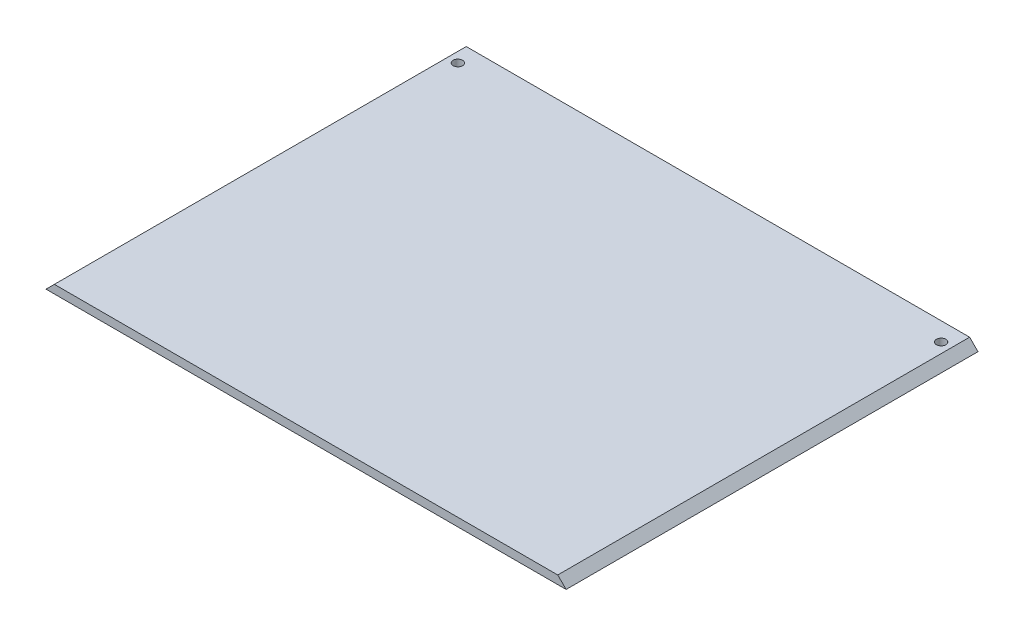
from build123d import *

# Parameters (mm, degrees)
SKETCH3_W               = 186.4
SKETCH3_H               = 147.6
BOSS_EXTRUDE1_DEPTH     = 3
CUT_EXTRUDE2_DEPTH      = 238.780823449
CUT_EXTRUDE2_DEPTH_BACK = 238.780823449
M3_CLEARANCE_HOLE2_D    = 3.4


with BuildPart() as part:
    # Sketch3 → Boss-Extrude1 (new body)
    with BuildSketch(Plane(origin=(0, 0, 0), x_dir=(1, 0, 0), z_dir=(0, 1, 0))):
        with Locations((93.2, 73.8)):
            Rectangle(SKETCH3_W, SKETCH3_H)
    extrude(amount=-BOSS_EXTRUDE1_DEPTH)

    # Sketch5 → Cut-Extrude2 (cut, two sides: drawn at the far end of the back side and taken through both)
    with BuildSketch(Plane.XY.offset(-CUT_EXTRUDE2_DEPTH_BACK)):
        Polygon((186.4, 0), (183.4, 0), (186.4, -3), align=None)
        Polygon((0, 0), (0, -3), (3, 0), align=None)
    extrude(amount=CUT_EXTRUDE2_DEPTH + CUT_EXTRUDE2_DEPTH_BACK, mode=Mode.SUBTRACT)

    # M3 Clearance Hole2 (through all)
    with Locations(Plane(origin=(0, 0, 0), x_dir=(1, 0, 0), z_dir=(0, 1, 0))):
        with Locations((6.6, 141), (179.8, 141)):
            Hole(M3_CLEARANCE_HOLE2_D / 2)


solid = part.part
